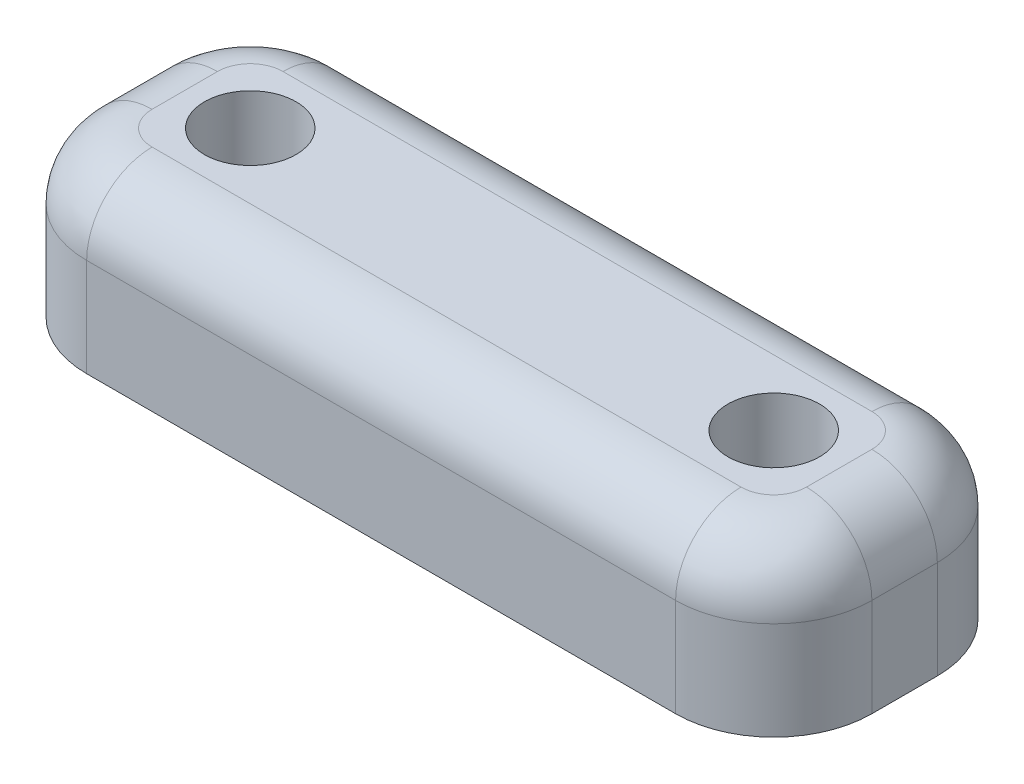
from build123d import *

# Parameters (mm, degrees)
SKETCH1_W           = 24
SKETCH1_H           = 8
SKETCH1_R           = 1.4
BOSS_EXTRUDE1_DEPTH = 5
FILLET1_R           = 3
FILLET2_R           = 2


with BuildPart() as part:
    # Sketch1 → Boss-Extrude1 (new body)
    with BuildSketch(Plane(origin=(0, 0, 0), x_dir=(1, 0, 0), z_dir=(0, 1, 0))):
        with Locations((0, -1.752347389)):
            Rectangle(SKETCH1_W, SKETCH1_H)
        with Locations(Location((-8, -1.752347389, 0), (0, 0, 270))):
            Circle(SKETCH1_R, mode=Mode.SUBTRACT)
        with Locations(Location((8, -1.752347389, 0), (0, 0, 270))):
            Circle(SKETCH1_R, mode=Mode.SUBTRACT)
    extrude(amount=BOSS_EXTRUDE1_DEPTH)

    # Fillet1
    fillet1_edges = [part.edges().sort_by_distance(p)[0] for p in [
        (-12, 2.5, -2.247652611),
        (12, 2.5, -2.247652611),
        (12, 2.5, 5.752347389),
        (-12, 2.5, 5.752347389),
    ]]
    fillet(fillet1_edges, radius=FILLET1_R)

    # Fillet2
    fillet2_edges = [part.edges().sort_by_distance(p)[0] for p in [
        (12, 5, 1.752347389),
        (0, 5, 5.752347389),
        (-12, 5, 1.752347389),
        (0, 5, -2.247652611),
        (-11.121320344, 5, -1.368972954),
        (-11.121320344, 5, 4.873667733),
        (11.121320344, 5, -1.368972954),
        (11.121320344, 5, 4.873667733),
    ]]
    fillet(fillet2_edges, radius=FILLET2_R)


solid = part.part
